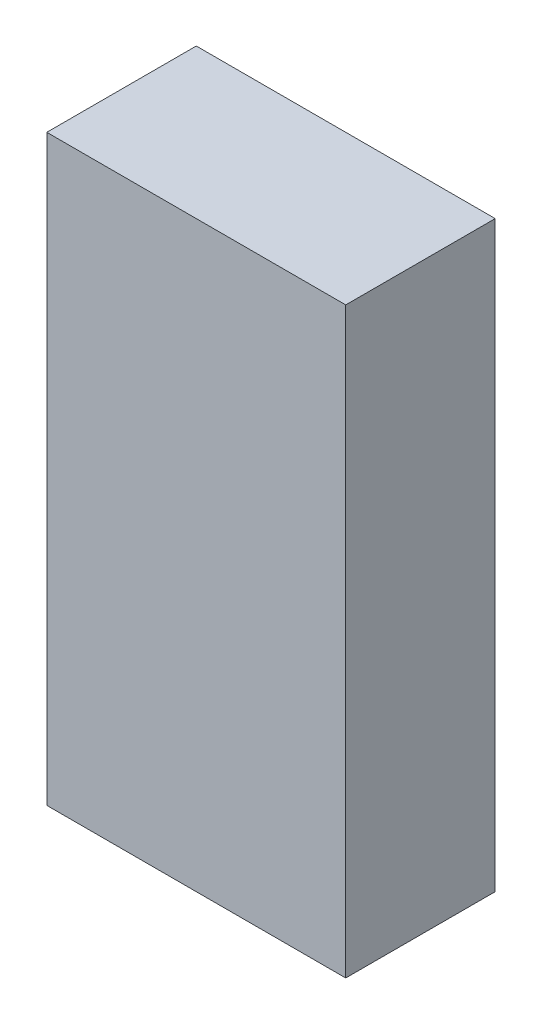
ISO-10303-21;
HEADER;
FILE_DESCRIPTION(('STEP AP214'),'2;1');
FILE_NAME('part.step','',(''),(''),'','','');
FILE_SCHEMA(('AUTOMOTIVE_DESIGN { 1 0 10303 214 1 1 1 1 }'));
ENDSEC;
DATA;
#1=APPLICATION_CONTEXT('core data for automotive mechanical design processes');
#2=APPLICATION_PROTOCOL_DEFINITION('international standard','automotive_design',2000,#1);
#3=PRODUCT_CONTEXT('',#1,'mechanical');
#4=PRODUCT('Part','Part','',(#3));
#5=PRODUCT_RELATED_PRODUCT_CATEGORY('part','',(#4));
#6=PRODUCT_DEFINITION_FORMATION('','',#4);
#7=PRODUCT_DEFINITION_CONTEXT('part definition',#1,'design');
#8=PRODUCT_DEFINITION('design','',#6,#7);
#9=PRODUCT_DEFINITION_SHAPE('','',#8);
#10=(LENGTH_UNIT() NAMED_UNIT(*) SI_UNIT(.MILLI.,.METRE.));
#11=(NAMED_UNIT(*) PLANE_ANGLE_UNIT() SI_UNIT($,.RADIAN.));
#12=(NAMED_UNIT(*) SI_UNIT($,.STERADIAN.) SOLID_ANGLE_UNIT());
#13=UNCERTAINTY_MEASURE_WITH_UNIT(LENGTH_MEASURE(1.E-05),#10,'distance_accuracy_value','');
#14=(GEOMETRIC_REPRESENTATION_CONTEXT(3) GLOBAL_UNCERTAINTY_ASSIGNED_CONTEXT((#13)) GLOBAL_UNIT_ASSIGNED_CONTEXT((#10,
#11,#12)) REPRESENTATION_CONTEXT('',''));
#15=CARTESIAN_POINT('',(0.,0.,0.));
#16=DIRECTION('',(0.,0.,1.));
#17=DIRECTION('',(1.,0.,0.));
#18=AXIS2_PLACEMENT_3D('',#15,#16,#17);
#19=CARTESIAN_POINT('',(0.,0.,0.5));
#20=DIRECTION('',(0.,0.,-1.));
#21=DIRECTION('',(0.,-1.,0.));
#22=AXIS2_PLACEMENT_3D('',#19,#20,#21);
#23=PLANE('',#22);
#24=DIRECTION('',(0.,1.,0.));
#25=VECTOR('',#24,1.);
#26=CARTESIAN_POINT('',(-0.5,-0.975,0.5));
#27=LINE('',#26,#25);
#28=CARTESIAN_POINT('',(-0.5,-0.975,0.5));
#29=VERTEX_POINT('',#28);
#30=CARTESIAN_POINT('',(-0.5,0.975,0.5));
#31=VERTEX_POINT('',#30);
#32=EDGE_CURVE('E25',#29,#31,#27,.T.);
#33=ORIENTED_EDGE('',*,*,#32,.F.);
#34=DIRECTION('',(-1.,0.,0.));
#35=VECTOR('',#34,1.);
#36=CARTESIAN_POINT('',(0.5,-0.975,0.5));
#37=LINE('',#36,#35);
#38=CARTESIAN_POINT('',(0.5,-0.975,0.5));
#39=VERTEX_POINT('',#38);
#40=EDGE_CURVE('E57',#39,#29,#37,.T.);
#41=ORIENTED_EDGE('',*,*,#40,.F.);
#42=DIRECTION('',(0.,-1.,0.));
#43=VECTOR('',#42,1.);
#44=CARTESIAN_POINT('',(0.5,0.975,0.5));
#45=LINE('',#44,#43);
#46=CARTESIAN_POINT('',(0.5,0.975,0.5));
#47=VERTEX_POINT('',#46);
#48=EDGE_CURVE('E73',#47,#39,#45,.T.);
#49=ORIENTED_EDGE('',*,*,#48,.F.);
#50=DIRECTION('',(1.,0.,0.));
#51=VECTOR('',#50,1.);
#52=CARTESIAN_POINT('',(-0.5,0.975,0.5));
#53=LINE('',#52,#51);
#54=EDGE_CURVE('E97',#31,#47,#53,.T.);
#55=ORIENTED_EDGE('',*,*,#54,.F.);
#56=EDGE_LOOP('',(#33,#41,#49,#55));
#57=FACE_BOUND('',#56,.T.);
#58=ADVANCED_FACE('F17',(#57),#23,.F.);
#59=CARTESIAN_POINT('',(0.,0.,0.));
#60=DIRECTION('',(0.,0.,-1.));
#61=DIRECTION('',(0.,-1.,0.));
#62=AXIS2_PLACEMENT_3D('',#59,#60,#61);
#63=PLANE('',#62);
#64=DIRECTION('',(1.,0.,0.));
#65=VECTOR('',#64,1.);
#66=CARTESIAN_POINT('',(-0.5,0.975,0.));
#67=LINE('',#66,#65);
#68=CARTESIAN_POINT('',(-0.5,0.975,0.));
#69=VERTEX_POINT('',#68);
#70=CARTESIAN_POINT('',(0.5,0.975,0.));
#71=VERTEX_POINT('',#70);
#72=EDGE_CURVE('E83',#69,#71,#67,.T.);
#73=ORIENTED_EDGE('',*,*,#72,.T.);
#74=DIRECTION('',(0.,-1.,0.));
#75=VECTOR('',#74,1.);
#76=CARTESIAN_POINT('',(0.5,0.975,0.));
#77=LINE('',#76,#75);
#78=CARTESIAN_POINT('',(0.5,-0.975,0.));
#79=VERTEX_POINT('',#78);
#80=EDGE_CURVE('E67',#71,#79,#77,.T.);
#81=ORIENTED_EDGE('',*,*,#80,.T.);
#82=DIRECTION('',(-1.,0.,0.));
#83=VECTOR('',#82,1.);
#84=CARTESIAN_POINT('',(0.5,-0.975,0.));
#85=LINE('',#84,#83);
#86=CARTESIAN_POINT('',(-0.5,-0.975,0.));
#87=VERTEX_POINT('',#86);
#88=EDGE_CURVE('E85',#79,#87,#85,.T.);
#89=ORIENTED_EDGE('',*,*,#88,.T.);
#90=DIRECTION('',(0.,1.,0.));
#91=VECTOR('',#90,1.);
#92=CARTESIAN_POINT('',(-0.5,-0.975,0.));
#93=LINE('',#92,#91);
#94=EDGE_CURVE('E11',#87,#69,#93,.T.);
#95=ORIENTED_EDGE('',*,*,#94,.T.);
#96=EDGE_LOOP('',(#73,#81,#89,#95));
#97=FACE_BOUND('',#96,.T.);
#98=ADVANCED_FACE('F82',(#97),#63,.T.);
#99=CARTESIAN_POINT('',(-0.5,-0.975,0.));
#100=DIRECTION('',(-1.,0.,0.));
#101=DIRECTION('',(0.,0.,1.));
#102=AXIS2_PLACEMENT_3D('',#99,#100,#101);
#103=PLANE('',#102);
#104=DIRECTION('',(0.,0.,1.));
#105=VECTOR('',#104,1.);
#106=CARTESIAN_POINT('',(-0.5,-0.975,0.));
#107=LINE('',#106,#105);
#108=EDGE_CURVE('E114',#87,#29,#107,.T.);
#109=ORIENTED_EDGE('',*,*,#108,.T.);
#110=ORIENTED_EDGE('',*,*,#32,.T.);
#111=DIRECTION('',(0.,0.,1.));
#112=VECTOR('',#111,1.);
#113=CARTESIAN_POINT('',(-0.5,0.975,0.));
#114=LINE('',#113,#112);
#115=EDGE_CURVE('E91',#69,#31,#114,.T.);
#116=ORIENTED_EDGE('',*,*,#115,.F.);
#117=ORIENTED_EDGE('',*,*,#94,.F.);
#118=EDGE_LOOP('',(#109,#110,#116,#117));
#119=FACE_BOUND('',#118,.T.);
#120=ADVANCED_FACE('F95',(#119),#103,.T.);
#121=CARTESIAN_POINT('',(0.5,-0.975,0.));
#122=DIRECTION('',(0.,-1.,0.));
#123=DIRECTION('',(0.,0.,-1.));
#124=AXIS2_PLACEMENT_3D('',#121,#122,#123);
#125=PLANE('',#124);
#126=DIRECTION('',(0.,0.,1.));
#127=VECTOR('',#126,1.);
#128=CARTESIAN_POINT('',(0.5,-0.975,0.));
#129=LINE('',#128,#127);
#130=EDGE_CURVE('E109',#79,#39,#129,.T.);
#131=ORIENTED_EDGE('',*,*,#130,.T.);
#132=ORIENTED_EDGE('',*,*,#40,.T.);
#133=ORIENTED_EDGE('',*,*,#108,.F.);
#134=ORIENTED_EDGE('',*,*,#88,.F.);
#135=EDGE_LOOP('',(#131,#132,#133,#134));
#136=FACE_BOUND('',#135,.T.);
#137=ADVANCED_FACE('F174',(#136),#125,.T.);
#138=CARTESIAN_POINT('',(0.5,0.975,0.));
#139=DIRECTION('',(1.,0.,0.));
#140=DIRECTION('',(0.,1.,0.));
#141=AXIS2_PLACEMENT_3D('',#138,#139,#140);
#142=PLANE('',#141);
#143=DIRECTION('',(0.,0.,1.));
#144=VECTOR('',#143,1.);
#145=CARTESIAN_POINT('',(0.5,0.975,0.));
#146=LINE('',#145,#144);
#147=EDGE_CURVE('E92',#71,#47,#146,.T.);
#148=ORIENTED_EDGE('',*,*,#147,.T.);
#149=ORIENTED_EDGE('',*,*,#48,.T.);
#150=ORIENTED_EDGE('',*,*,#130,.F.);
#151=ORIENTED_EDGE('',*,*,#80,.F.);
#152=EDGE_LOOP('',(#148,#149,#150,#151));
#153=FACE_BOUND('',#152,.T.);
#154=ADVANCED_FACE('F164',(#153),#142,.T.);
#155=CARTESIAN_POINT('',(-0.5,0.975,0.));
#156=DIRECTION('',(0.,1.,0.));
#157=DIRECTION('',(1.,0.,0.));
#158=AXIS2_PLACEMENT_3D('',#155,#156,#157);
#159=PLANE('',#158);
#160=ORIENTED_EDGE('',*,*,#115,.T.);
#161=ORIENTED_EDGE('',*,*,#54,.T.);
#162=ORIENTED_EDGE('',*,*,#147,.F.);
#163=ORIENTED_EDGE('',*,*,#72,.F.);
#164=EDGE_LOOP('',(#160,#161,#162,#163));
#165=FACE_BOUND('',#164,.T.);
#166=ADVANCED_FACE('F89',(#165),#159,.T.);
#167=CLOSED_SHELL('',(#58,#98,#120,#137,#154,#166));
#168=MANIFOLD_SOLID_BREP('B1',#167);
#169=ADVANCED_BREP_SHAPE_REPRESENTATION('',(#18,#168),#14);
#170=SHAPE_DEFINITION_REPRESENTATION(#9,#169);
ENDSEC;
END-ISO-10303-21;
